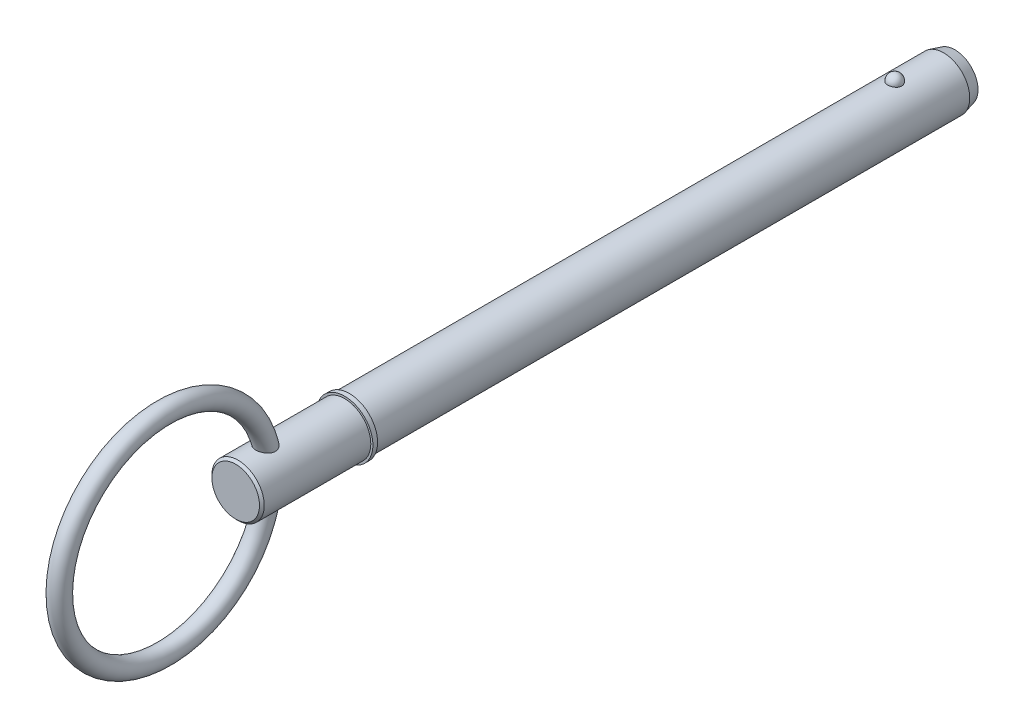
from build123d import *

# Parameters (mm, degrees)
SKETCH2_R           = 5.555
BOSS_EXTRUDE1_DEPTH = 114.3
BOSS_EXTRUDE2_START = 14.27
SKETCH3_R           = 5.555
BOSS_EXTRUDE2_DEPTH = 14.27
CHAMFER1_SIZE       = 2.4
CHAMFER1_SIZE2      = 0.643078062
SKETCH20_W          = 1
SKETCH20_H          = 6
SKETCH21_R          = 5.555
BOSS_EXTRUDE3_DEPTH = 24.13
CHAMFER2_SIZE       = 0.5
SKETCH24_R          = 2


with BuildPart() as part:
    # Sketch2 → Boss-Extrude1 (new body)
    with BuildSketch(Plane.XY):
        Circle(SKETCH2_R)
    extrude(amount=BOSS_EXTRUDE1_DEPTH)

    # Sketch3 → Boss-Extrude2 (add)
    with BuildSketch(Plane(origin=(0, 0, 0), x_dir=(-1, 0, 0), z_dir=(0, 0, -1)).offset(BOSS_EXTRUDE2_START)):
        Circle(SKETCH3_R)
    extrude(amount=-BOSS_EXTRUDE2_DEPTH)

    # Chamfer1
    chamfer1_edges = [part.edges().sort_by_distance(p)[0] for p in [
        (5.555, 0, -14.27),
    ]]
    chamfer1_side = [part.faces().sort_by_distance(p)[0] for p in [
        (5.555, 0, -7.135),
    ]]
    chamfer(chamfer1_edges, length=CHAMFER1_SIZE, length2=CHAMFER1_SIZE2, reference=chamfer1_side[0])

    # Sketch18 → Revolve1 (revolve)
    with BuildSketch(Plane(origin=(0, 0, 0), x_dir=(0, 0, -1), z_dir=(1, 0, 0))):
        with BuildLine():
            Line((1.49, 7.045), (1.49, 4.065))
            ThreePointArc((1.49, 4.065), (0, 5.555), (1.49, 7.045))
        make_face()
    revolve(axis=Axis((0, 7.045, -1.49), (0, -1, 0)))

    # Sketch20 → Revolve2 (revolve)
    with BuildSketch(Plane(origin=(0, 0, 0), x_dir=(0, 0, -1), z_dir=(1, 0, 0)), mode=Mode.PRIVATE) as revolve2_sk:
        with Locations((-114.8, 3)):
            Rectangle(SKETCH20_W, SKETCH20_H)
    revolve(revolve2_sk.sketch.rotate(Axis((0, 0, 33.728787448), (0, 0, 1)), 90), axis=Axis((0, 0, 33.728787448), (0, 0, 1)))

    # Sketch21 → Boss-Extrude3 (add)
    with BuildSketch(Plane(origin=(0, 0, 114.3), x_dir=(-1, 0, 0), z_dir=(0, 0, -1))):
        Circle(SKETCH21_R)
    extrude(amount=-BOSS_EXTRUDE3_DEPTH)

    # Chamfer2
    chamfer2_edges = [part.edges().sort_by_distance(p)[0] for p in [
        (5.555, 0, 138.43),
    ]]
    chamfer(chamfer2_edges, length=CHAMFER2_SIZE)

    # Sweep1: sweep along a path in Sketch23
    with BuildLine(Plane(origin=(0, 0, 0), x_dir=(0, 0, -1), z_dir=(1, 0, 0))) as sweep1_path:
        CenterArc((-153.655, 0), 22.225, 0, 360)
    # Sketch24 → Sweep1 (sweep)
    with BuildSketch(Plane(origin=(0, 0, 0), x_dir=(1, 0, 0), z_dir=(0, 1, 0))):
        with Locations((0, -131.43)):
            Circle(SKETCH24_R)
    sweep(path=sweep1_path.line)


solid = part.part
